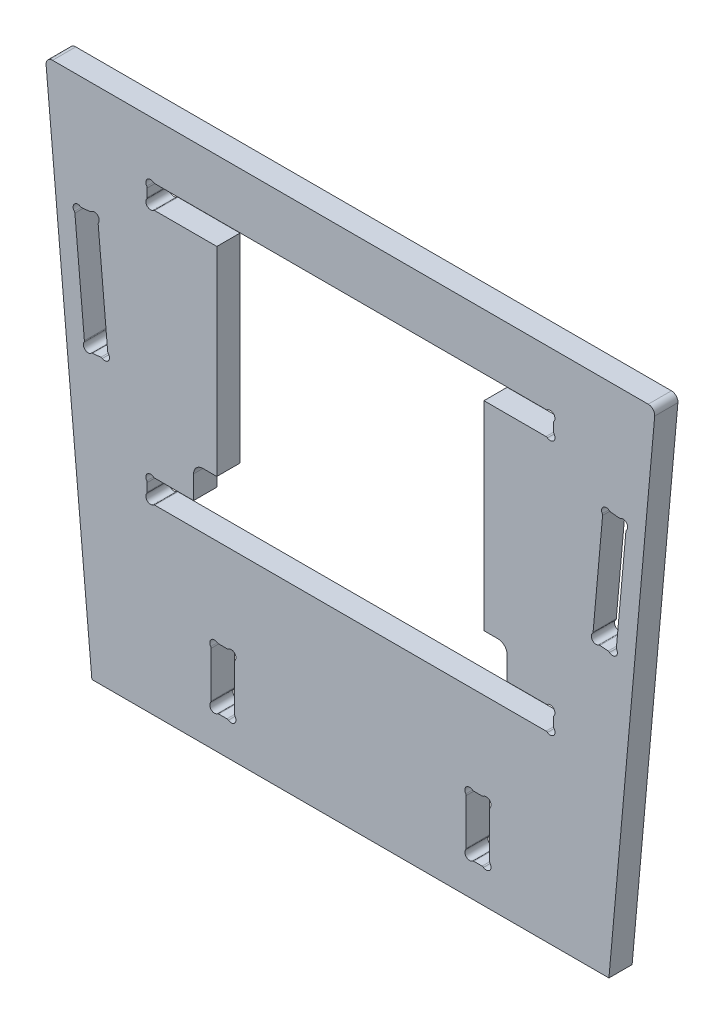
from build123d import *

# Parameters (mm, degrees)
BOSS_EXTRUDE1_DEPTH = 25
CUT_EXTRUDE1_DEPTH  = 623.799727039
FILLET1_R           = 7


with BuildPart() as part:
    # Sketch1 → Boss-Extrude1 (new body)
    with BuildSketch(Plane.XY):
        with BuildLine():
            Line((0, 0), (-50, 556.5))
            Line((-50, 556.5), (278.5, 556.5))
            Line((278.5, 556.5), (278.5, 496.5))
            Line((278.5, 496.5), (67.747339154, 496.5))
            ThreePointArc((67.747339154, 496.5), (66.963624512, 496.626017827), (66.258919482, 496.991366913))
            ThreePointArc((66.258919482, 496.991366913), (59.616298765, 496.5), (59.124931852, 489.857379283))
            ThreePointArc((59.124931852, 489.857379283), (59.490280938, 489.152674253), (59.616298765, 488.368959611))
            Line((59.616298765, 488.368959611), (59.616298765, 479.431040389))
            ThreePointArc((59.616298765, 479.431040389), (59.490280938, 478.647325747), (59.124931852, 477.942620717))
            ThreePointArc((59.124931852, 477.942620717), (59.616298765, 471.3), (66.258919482, 470.808633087))
            ThreePointArc((66.258919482, 470.808633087), (66.963624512, 471.173982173), (67.747339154, 471.3))
            Line((67.747339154, 471.3), (134.616298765, 471.3))
            Line((134.616298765, 471.3), (134.616298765, 256.7))
            Line((134.616298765, 256.7), (119.616298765, 256.7))
            ThreePointArc((119.616298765, 256.7), (112.545230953, 253.771067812), (109.616298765, 246.7))
            Line((109.616298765, 246.7), (109.616298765, 221.7))
            Line((109.616298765, 221.7), (67.747339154, 221.7))
            ThreePointArc((67.747339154, 221.7), (66.963624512, 221.826017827), (66.258919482, 222.191366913))
            ThreePointArc((66.258919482, 222.191366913), (59.616298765, 221.7), (59.124931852, 215.057379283))
            ThreePointArc((59.124931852, 215.057379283), (59.490280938, 214.352674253), (59.616298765, 213.568959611))
            Line((59.616298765, 213.568959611), (59.616298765, 204.631040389))
            ThreePointArc((59.616298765, 204.631040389), (59.490280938, 203.847325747), (59.124931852, 203.142620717))
            ThreePointArc((59.124931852, 203.142620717), (59.616298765, 196.5), (66.258919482, 196.008633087))
            ThreePointArc((66.258919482, 196.008633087), (66.963624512, 196.373982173), (67.747339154, 196.5))
            Line((67.747339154, 196.5), (278.5, 196.5))
            Line((278.5, 196.5), (278.5, 0))
            Line((278.5, 0), (0, 0))
        make_face()
    extrude(amount=BOSS_EXTRUDE1_DEPTH)

    # Sketch2 → Cut-Extrude1 (cut, through all)
    with BuildSketch(Plane.XY):
        with BuildLine():
            Line((6.810346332, 428.185828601), (17.04208007, 314.306632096))
            ThreePointArc((17.04208007, 314.306632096), (17.237724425, 313.53733864), (17.664669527, 312.868154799))
            ThreePointArc((17.664669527, 312.868154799), (17.7697008, 306.208213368), (11.197701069, 305.124390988))
            ThreePointArc((11.197701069, 305.124390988), (10.463129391, 305.425212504), (9.671282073, 305.480592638))
            Line((9.671282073, 305.480592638), (0.769221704, 304.680766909))
            ThreePointArc((0.769221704, 304.680766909), (-7.1751e-05, 304.485122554), (-0.669255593, 304.058177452))
            ThreePointArc((-0.669255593, 304.058177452), (-7.329197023, 303.953146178), (-8.413019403, 310.52514591))
            ThreePointArc((-8.413019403, 310.52514591), (-8.112197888, 311.259717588), (-8.056817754, 312.051564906))
            Line((-8.056817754, 312.051564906), (-18.288551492, 425.930761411))
            ThreePointArc((-18.288551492, 425.930761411), (-18.484195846, 426.700054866), (-18.911140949, 427.369238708))
            ThreePointArc((-18.911140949, 427.369238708), (-19.016172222, 434.029180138), (-12.44417249, 435.113002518))
            ThreePointArc((-12.44417249, 435.113002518), (-11.709600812, 434.812181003), (-10.917753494, 434.756800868))
            Line((-10.917753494, 434.756800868), (-2.015693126, 435.556626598))
            ThreePointArc((-2.015693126, 435.556626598), (-1.24639967, 435.752270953), (-0.577215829, 436.179216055))
            ThreePointArc((-0.577215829, 436.179216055), (6.082725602, 436.284247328), (7.166547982, 429.712247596))
            ThreePointArc((7.166547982, 429.712247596), (6.865726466, 428.977675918), (6.810346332, 428.185828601))
        make_face()
        with BuildLine():
            Line((128.5, 44.231040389), (128.5, 93.368959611))
            ThreePointArc((128.5, 93.368959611), (128.373982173, 94.152674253), (128.008633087, 94.857379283))
            ThreePointArc((128.008633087, 94.857379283), (128.5, 101.5), (135.142620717, 101.991366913))
            ThreePointArc((135.142620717, 101.991366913), (135.847325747, 101.626017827), (136.631040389, 101.5))
            Line((136.631040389, 101.5), (145.568959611, 101.5))
            ThreePointArc((145.568959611, 101.5), (146.352674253, 101.626017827), (147.057379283, 101.991366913))
            ThreePointArc((147.057379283, 101.991366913), (153.7, 101.5), (154.191366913, 94.857379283))
            ThreePointArc((154.191366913, 94.857379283), (153.826017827, 94.152674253), (153.7, 93.368959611))
            Line((153.7, 93.368959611), (153.7, 44.231040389))
            ThreePointArc((153.7, 44.231040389), (153.826017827, 43.447325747), (154.191366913, 42.742620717))
            ThreePointArc((154.191366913, 42.742620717), (153.7, 36.1), (147.057379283, 35.608633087))
            ThreePointArc((147.057379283, 35.608633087), (146.352674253, 35.973982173), (145.568959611, 36.1))
            Line((145.568959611, 36.1), (136.631040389, 36.1))
            ThreePointArc((136.631040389, 36.1), (135.847325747, 35.973982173), (135.142620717, 35.608633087))
            ThreePointArc((135.142620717, 35.608633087), (128.5, 36.1), (128.008633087, 42.742620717))
            ThreePointArc((128.008633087, 42.742620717), (128.373982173, 43.447325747), (128.5, 44.231040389))
        make_face()
    extrude(amount=CUT_EXTRUDE1_DEPTH, mode=Mode.SUBTRACT)

    # Fillet1
    fillet1_edges = [part.edges().sort_by_distance(p)[0] for p in [
        (-50, 556.5, 12.5),
    ]]
    fillet(fillet1_edges, radius=FILLET1_R)

    # Sym_trie1: part across plane


with BuildPart() as part_1:
    add(part.part)
    add(part.part.mirror(Plane(origin=(278.5, 556.5, 25), x_dir=(0, 0, 1), z_dir=(1, 0, 0))))


solid = part_1.part
